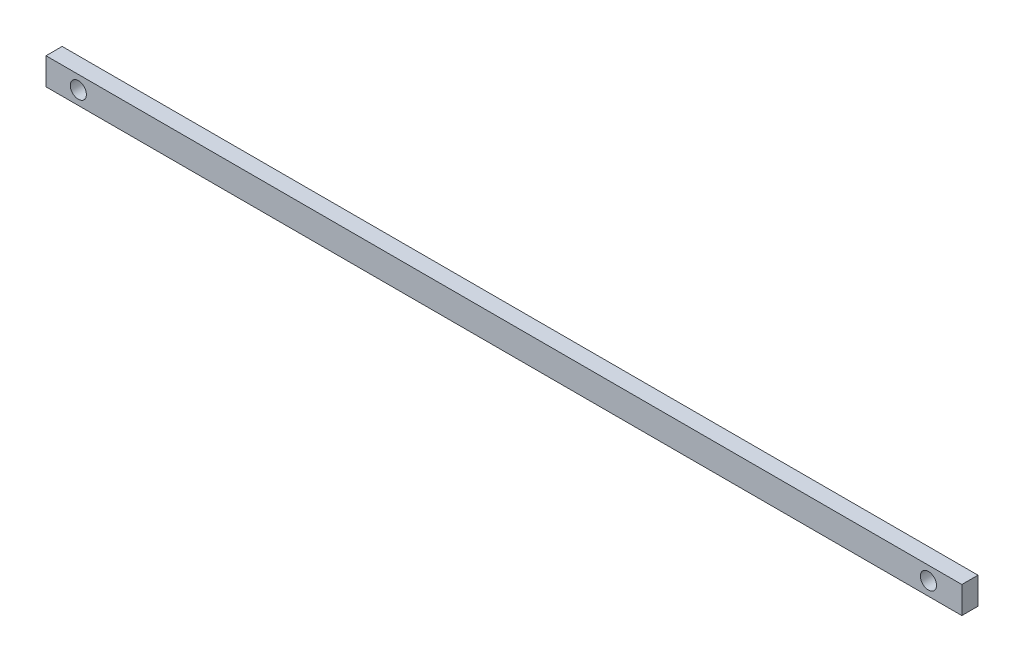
ISO-10303-21;
HEADER;
FILE_DESCRIPTION(('STEP AP214'),'2;1');
FILE_NAME('part.step','',(''),(''),'','','');
FILE_SCHEMA(('AUTOMOTIVE_DESIGN { 1 0 10303 214 1 1 1 1 }'));
ENDSEC;
DATA;
#1=APPLICATION_CONTEXT('core data for automotive mechanical design processes');
#2=APPLICATION_PROTOCOL_DEFINITION('international standard','automotive_design',2000,#1);
#3=PRODUCT_CONTEXT('',#1,'mechanical');
#4=PRODUCT('Part','Part','',(#3));
#5=PRODUCT_RELATED_PRODUCT_CATEGORY('part','',(#4));
#6=PRODUCT_DEFINITION_FORMATION('','',#4);
#7=PRODUCT_DEFINITION_CONTEXT('part definition',#1,'design');
#8=PRODUCT_DEFINITION('design','',#6,#7);
#9=PRODUCT_DEFINITION_SHAPE('','',#8);
#10=(LENGTH_UNIT() NAMED_UNIT(*) SI_UNIT(.MILLI.,.METRE.));
#11=(NAMED_UNIT(*) PLANE_ANGLE_UNIT() SI_UNIT($,.RADIAN.));
#12=(NAMED_UNIT(*) SI_UNIT($,.STERADIAN.) SOLID_ANGLE_UNIT());
#13=UNCERTAINTY_MEASURE_WITH_UNIT(LENGTH_MEASURE(1.E-05),#10,'distance_accuracy_value','');
#14=(GEOMETRIC_REPRESENTATION_CONTEXT(3) GLOBAL_UNCERTAINTY_ASSIGNED_CONTEXT((#13)) GLOBAL_UNIT_ASSIGNED_CONTEXT((#10,
#11,#12)) REPRESENTATION_CONTEXT('',''));
#15=CARTESIAN_POINT('',(0.,0.,0.));
#16=DIRECTION('',(0.,0.,1.));
#17=DIRECTION('',(1.,0.,0.));
#18=AXIS2_PLACEMENT_3D('',#15,#16,#17);
#19=CARTESIAN_POINT('',(0.,0.,15.));
#20=DIRECTION('',(0.,0.,-1.));
#21=DIRECTION('',(-1.,0.,0.));
#22=AXIS2_PLACEMENT_3D('',#19,#20,#21);
#23=PLANE('',#22);
#24=DIRECTION('',(0.,-1.,0.));
#25=VECTOR('',#24,1.);
#26=CARTESIAN_POINT('',(0.,0.,15.));
#27=LINE('',#26,#25);
#28=CARTESIAN_POINT('',(0.,25.,15.));
#29=VERTEX_POINT('',#28);
#30=CARTESIAN_POINT('',(0.,0.,15.));
#31=VERTEX_POINT('',#30);
#32=EDGE_CURVE('E85',#29,#31,#27,.T.);
#33=ORIENTED_EDGE('',*,*,#32,.T.);
#34=DIRECTION('',(1.,0.,0.));
#35=VECTOR('',#34,1.);
#36=CARTESIAN_POINT('',(0.,0.,15.));
#37=LINE('',#36,#35);
#38=CARTESIAN_POINT('',(850.,0.,15.));
#39=VERTEX_POINT('',#38);
#40=EDGE_CURVE('E80',#31,#39,#37,.T.);
#41=ORIENTED_EDGE('',*,*,#40,.T.);
#42=DIRECTION('',(0.,1.,0.));
#43=VECTOR('',#42,1.);
#44=CARTESIAN_POINT('',(850.,0.,15.));
#45=LINE('',#44,#43);
#46=CARTESIAN_POINT('',(850.,25.,15.));
#47=VERTEX_POINT('',#46);
#48=EDGE_CURVE('E83',#39,#47,#45,.T.);
#49=ORIENTED_EDGE('',*,*,#48,.T.);
#50=DIRECTION('',(-1.,0.,0.));
#51=VECTOR('',#50,1.);
#52=CARTESIAN_POINT('',(0.,25.,15.));
#53=LINE('',#52,#51);
#54=EDGE_CURVE('E50',#47,#29,#53,.T.);
#55=ORIENTED_EDGE('',*,*,#54,.T.);
#56=EDGE_LOOP('',(#33,#41,#49,#55));
#57=FACE_BOUND('',#56,.T.);
#58=CARTESIAN_POINT('',(30.,12.5,15.));
#59=DIRECTION('',(0.,0.,1.));
#60=DIRECTION('',(1.,0.,0.));
#61=AXIS2_PLACEMENT_3D('',#58,#59,#60);
#62=CIRCLE('',#61,7.5);
#63=CARTESIAN_POINT('',(37.5,12.5,15.));
#64=VERTEX_POINT('',#63);
#65=EDGE_CURVE('E100',#64,#64,#62,.T.);
#66=ORIENTED_EDGE('',*,*,#65,.F.);
#67=EDGE_LOOP('',(#66));
#68=FACE_BOUND('',#67,.T.);
#69=CARTESIAN_POINT('',(819.,12.5,15.));
#70=DIRECTION('',(0.,0.,1.));
#71=DIRECTION('',(1.,0.,0.));
#72=AXIS2_PLACEMENT_3D('',#69,#70,#71);
#73=CIRCLE('',#72,7.49999999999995);
#74=CARTESIAN_POINT('',(826.5,12.5,15.));
#75=VERTEX_POINT('',#74);
#76=EDGE_CURVE('E115',#75,#75,#73,.T.);
#77=ORIENTED_EDGE('',*,*,#76,.F.);
#78=EDGE_LOOP('',(#77));
#79=FACE_BOUND('',#78,.T.);
#80=ADVANCED_FACE('F33',(#57,#68,#79),#23,.F.);
#81=CARTESIAN_POINT('',(0.,0.,0.));
#82=DIRECTION('',(0.,0.,-1.));
#83=DIRECTION('',(-1.,0.,0.));
#84=AXIS2_PLACEMENT_3D('',#81,#82,#83);
#85=PLANE('',#84);
#86=CARTESIAN_POINT('',(30.,12.5,0.));
#87=DIRECTION('',(0.,0.,1.));
#88=DIRECTION('',(1.,0.,0.));
#89=AXIS2_PLACEMENT_3D('',#86,#87,#88);
#90=CIRCLE('',#89,7.5);
#91=CARTESIAN_POINT('',(37.5,12.5,0.));
#92=VERTEX_POINT('',#91);
#93=EDGE_CURVE('E112',#92,#92,#90,.T.);
#94=ORIENTED_EDGE('',*,*,#93,.T.);
#95=EDGE_LOOP('',(#94));
#96=FACE_BOUND('',#95,.T.);
#97=DIRECTION('',(0.,-1.,0.));
#98=VECTOR('',#97,1.);
#99=CARTESIAN_POINT('',(0.,0.,0.));
#100=LINE('',#99,#98);
#101=CARTESIAN_POINT('',(0.,25.,0.));
#102=VERTEX_POINT('',#101);
#103=CARTESIAN_POINT('',(0.,0.,0.));
#104=VERTEX_POINT('',#103);
#105=EDGE_CURVE('E97',#102,#104,#100,.T.);
#106=ORIENTED_EDGE('',*,*,#105,.F.);
#107=DIRECTION('',(-1.,0.,0.));
#108=VECTOR('',#107,1.);
#109=CARTESIAN_POINT('',(0.,25.,0.));
#110=LINE('',#109,#108);
#111=CARTESIAN_POINT('',(850.,25.,0.));
#112=VERTEX_POINT('',#111);
#113=EDGE_CURVE('E73',#112,#102,#110,.T.);
#114=ORIENTED_EDGE('',*,*,#113,.F.);
#115=DIRECTION('',(0.,1.,0.));
#116=VECTOR('',#115,1.);
#117=CARTESIAN_POINT('',(850.,0.,0.));
#118=LINE('',#117,#116);
#119=CARTESIAN_POINT('',(850.,0.,0.));
#120=VERTEX_POINT('',#119);
#121=EDGE_CURVE('E67',#120,#112,#118,.T.);
#122=ORIENTED_EDGE('',*,*,#121,.F.);
#123=DIRECTION('',(1.,0.,0.));
#124=VECTOR('',#123,1.);
#125=CARTESIAN_POINT('',(0.,0.,0.));
#126=LINE('',#125,#124);
#127=EDGE_CURVE('E89',#104,#120,#126,.T.);
#128=ORIENTED_EDGE('',*,*,#127,.F.);
#129=EDGE_LOOP('',(#106,#114,#122,#128));
#130=FACE_BOUND('',#129,.T.);
#131=CARTESIAN_POINT('',(819.,12.5,0.));
#132=DIRECTION('',(0.,0.,1.));
#133=DIRECTION('',(1.,0.,0.));
#134=AXIS2_PLACEMENT_3D('',#131,#132,#133);
#135=CIRCLE('',#134,7.49999999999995);
#136=CARTESIAN_POINT('',(826.5,12.5,0.));
#137=VERTEX_POINT('',#136);
#138=EDGE_CURVE('E118',#137,#137,#135,.T.);
#139=ORIENTED_EDGE('',*,*,#138,.T.);
#140=EDGE_LOOP('',(#139));
#141=FACE_BOUND('',#140,.T.);
#142=ADVANCED_FACE('F108',(#96,#130,#141),#85,.T.);
#143=CARTESIAN_POINT('',(0.,0.,15.));
#144=DIRECTION('',(1.,0.,0.));
#145=DIRECTION('',(0.,0.,-1.));
#146=AXIS2_PLACEMENT_3D('',#143,#144,#145);
#147=PLANE('',#146);
#148=ORIENTED_EDGE('',*,*,#105,.T.);
#149=DIRECTION('',(0.,0.,-1.));
#150=VECTOR('',#149,1.);
#151=CARTESIAN_POINT('',(0.,0.,15.));
#152=LINE('',#151,#150);
#153=EDGE_CURVE('E11',#31,#104,#152,.T.);
#154=ORIENTED_EDGE('',*,*,#153,.F.);
#155=ORIENTED_EDGE('',*,*,#32,.F.);
#156=DIRECTION('',(0.,0.,-1.));
#157=VECTOR('',#156,1.);
#158=CARTESIAN_POINT('',(0.,25.,15.));
#159=LINE('',#158,#157);
#160=EDGE_CURVE('E93',#29,#102,#159,.T.);
#161=ORIENTED_EDGE('',*,*,#160,.T.);
#162=EDGE_LOOP('',(#148,#154,#155,#161));
#163=FACE_BOUND('',#162,.T.);
#164=ADVANCED_FACE('F35',(#163),#147,.F.);
#165=CARTESIAN_POINT('',(0.,0.,15.));
#166=DIRECTION('',(0.,1.,0.));
#167=DIRECTION('',(0.,0.,1.));
#168=AXIS2_PLACEMENT_3D('',#165,#166,#167);
#169=PLANE('',#168);
#170=ORIENTED_EDGE('',*,*,#127,.T.);
#171=DIRECTION('',(0.,0.,-1.));
#172=VECTOR('',#171,1.);
#173=CARTESIAN_POINT('',(850.,0.,15.));
#174=LINE('',#173,#172);
#175=EDGE_CURVE('E42',#39,#120,#174,.T.);
#176=ORIENTED_EDGE('',*,*,#175,.F.);
#177=ORIENTED_EDGE('',*,*,#40,.F.);
#178=ORIENTED_EDGE('',*,*,#153,.T.);
#179=EDGE_LOOP('',(#170,#176,#177,#178));
#180=FACE_BOUND('',#179,.T.);
#181=ADVANCED_FACE('F88',(#180),#169,.F.);
#182=CARTESIAN_POINT('',(850.,0.,15.));
#183=DIRECTION('',(-1.,0.,0.));
#184=DIRECTION('',(0.,0.,1.));
#185=AXIS2_PLACEMENT_3D('',#182,#183,#184);
#186=PLANE('',#185);
#187=ORIENTED_EDGE('',*,*,#121,.T.);
#188=DIRECTION('',(0.,0.,-1.));
#189=VECTOR('',#188,1.);
#190=CARTESIAN_POINT('',(850.,25.,15.));
#191=LINE('',#190,#189);
#192=EDGE_CURVE('E90',#47,#112,#191,.T.);
#193=ORIENTED_EDGE('',*,*,#192,.F.);
#194=ORIENTED_EDGE('',*,*,#48,.F.);
#195=ORIENTED_EDGE('',*,*,#175,.T.);
#196=EDGE_LOOP('',(#187,#193,#194,#195));
#197=FACE_BOUND('',#196,.T.);
#198=ADVANCED_FACE('F91',(#197),#186,.F.);
#199=CARTESIAN_POINT('',(0.,25.,15.));
#200=DIRECTION('',(0.,-1.,0.));
#201=DIRECTION('',(0.,0.,-1.));
#202=AXIS2_PLACEMENT_3D('',#199,#200,#201);
#203=PLANE('',#202);
#204=ORIENTED_EDGE('',*,*,#113,.T.);
#205=ORIENTED_EDGE('',*,*,#160,.F.);
#206=ORIENTED_EDGE('',*,*,#54,.F.);
#207=ORIENTED_EDGE('',*,*,#192,.T.);
#208=EDGE_LOOP('',(#204,#205,#206,#207));
#209=FACE_BOUND('',#208,.T.);
#210=ADVANCED_FACE('F105',(#209),#203,.F.);
#211=CARTESIAN_POINT('',(30.,12.5,15.));
#212=DIRECTION('',(0.,0.,-1.));
#213=DIRECTION('',(-1.,0.,0.));
#214=AXIS2_PLACEMENT_3D('',#211,#212,#213);
#215=CYLINDRICAL_SURFACE('',#214,7.5);
#216=ORIENTED_EDGE('',*,*,#65,.T.);
#217=EDGE_LOOP('',(#216));
#218=FACE_BOUND('',#217,.T.);
#219=ORIENTED_EDGE('',*,*,#93,.F.);
#220=EDGE_LOOP('',(#219));
#221=FACE_BOUND('',#220,.T.);
#222=ADVANCED_FACE('F135',(#218,#221),#215,.F.);
#223=CARTESIAN_POINT('',(819.,12.5,15.));
#224=DIRECTION('',(0.,0.,-1.));
#225=DIRECTION('',(-1.,0.,0.));
#226=AXIS2_PLACEMENT_3D('',#223,#224,#225);
#227=CYLINDRICAL_SURFACE('',#226,7.49999999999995);
#228=ORIENTED_EDGE('',*,*,#76,.T.);
#229=EDGE_LOOP('',(#228));
#230=FACE_BOUND('',#229,.T.);
#231=ORIENTED_EDGE('',*,*,#138,.F.);
#232=EDGE_LOOP('',(#231));
#233=FACE_BOUND('',#232,.T.);
#234=ADVANCED_FACE('F124',(#230,#233),#227,.F.);
#235=CLOSED_SHELL('',(#80,#142,#164,#181,#198,#210,#222,#234));
#236=MANIFOLD_SOLID_BREP('B2',#235);
#237=ADVANCED_BREP_SHAPE_REPRESENTATION('',(#18,#236),#14);
#238=SHAPE_DEFINITION_REPRESENTATION(#9,#237);
ENDSEC;
END-ISO-10303-21;
